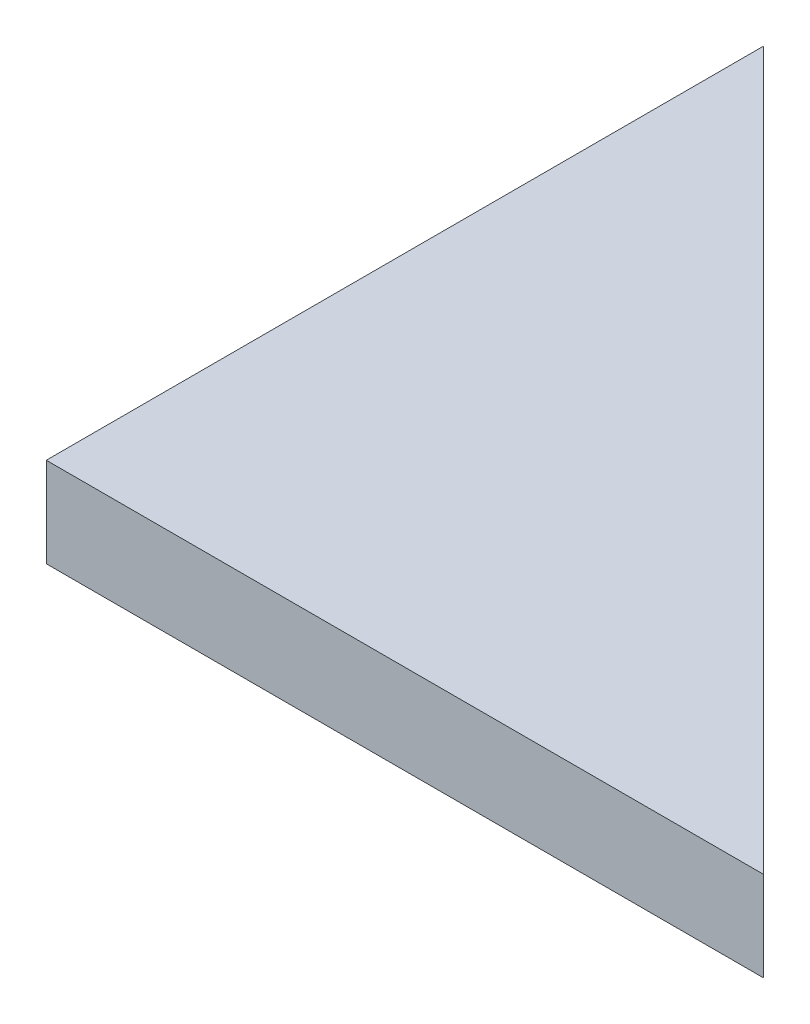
ISO-10303-21;
HEADER;
FILE_DESCRIPTION(('STEP AP214'),'2;1');
FILE_NAME('part.step','',(''),(''),'','','');
FILE_SCHEMA(('AUTOMOTIVE_DESIGN { 1 0 10303 214 1 1 1 1 }'));
ENDSEC;
DATA;
#1=APPLICATION_CONTEXT('core data for automotive mechanical design processes');
#2=APPLICATION_PROTOCOL_DEFINITION('international standard','automotive_design',2000,#1);
#3=PRODUCT_CONTEXT('',#1,'mechanical');
#4=PRODUCT('Part','Part','',(#3));
#5=PRODUCT_RELATED_PRODUCT_CATEGORY('part','',(#4));
#6=PRODUCT_DEFINITION_FORMATION('','',#4);
#7=PRODUCT_DEFINITION_CONTEXT('part definition',#1,'design');
#8=PRODUCT_DEFINITION('design','',#6,#7);
#9=PRODUCT_DEFINITION_SHAPE('','',#8);
#10=(LENGTH_UNIT() NAMED_UNIT(*) SI_UNIT(.MILLI.,.METRE.));
#11=(NAMED_UNIT(*) PLANE_ANGLE_UNIT() SI_UNIT($,.RADIAN.));
#12=(NAMED_UNIT(*) SI_UNIT($,.STERADIAN.) SOLID_ANGLE_UNIT());
#13=UNCERTAINTY_MEASURE_WITH_UNIT(LENGTH_MEASURE(1.E-05),#10,'distance_accuracy_value','');
#14=(GEOMETRIC_REPRESENTATION_CONTEXT(3) GLOBAL_UNCERTAINTY_ASSIGNED_CONTEXT((#13)) GLOBAL_UNIT_ASSIGNED_CONTEXT((#10,
#11,#12)) REPRESENTATION_CONTEXT('',''));
#15=CARTESIAN_POINT('',(0.,0.,0.));
#16=DIRECTION('',(0.,0.,1.));
#17=DIRECTION('',(1.,0.,0.));
#18=AXIS2_PLACEMENT_3D('',#15,#16,#17);
#19=CARTESIAN_POINT('',(-16.9333333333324,6.35,16.9333333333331));
#20=DIRECTION('',(0.,-1.,0.));
#21=DIRECTION('',(0.,0.,-1.));
#22=AXIS2_PLACEMENT_3D('',#19,#20,#21);
#23=PLANE('',#22);
#24=DIRECTION('',(1.,0.,0.));
#25=VECTOR('',#24,1.);
#26=CARTESIAN_POINT('',(-50.8,6.35,50.8));
#27=LINE('',#26,#25);
#28=CARTESIAN_POINT('',(50.8,6.35,50.8));
#29=VERTEX_POINT('',#28);
#30=CARTESIAN_POINT('',(-50.8,6.35,50.8));
#31=VERTEX_POINT('',#30);
#32=EDGE_CURVE('E19',#29,#31,#27,.F.);
#33=ORIENTED_EDGE('',*,*,#32,.F.);
#34=DIRECTION('',(-0.707106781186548,0.,-0.707106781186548));
#35=VECTOR('',#34,1.);
#36=CARTESIAN_POINT('',(50.8,6.35,50.8));
#37=LINE('',#36,#35);
#38=CARTESIAN_POINT('',(-50.8,6.35,-50.8));
#39=VERTEX_POINT('',#38);
#40=EDGE_CURVE('E58',#39,#29,#37,.F.);
#41=ORIENTED_EDGE('',*,*,#40,.F.);
#42=DIRECTION('',(0.,0.,1.));
#43=VECTOR('',#42,1.);
#44=CARTESIAN_POINT('',(-50.8,6.35,-50.8));
#45=LINE('',#44,#43);
#46=EDGE_CURVE('E47',#31,#39,#45,.F.);
#47=ORIENTED_EDGE('',*,*,#46,.F.);
#48=EDGE_LOOP('',(#33,#41,#47));
#49=FACE_BOUND('',#48,.T.);
#50=ADVANCED_FACE('F16',(#49),#23,.F.);
#51=CARTESIAN_POINT('',(-50.8,6.35,50.8));
#52=DIRECTION('',(0.,0.,1.));
#53=DIRECTION('',(1.,0.,0.));
#54=AXIS2_PLACEMENT_3D('',#51,#52,#53);
#55=PLANE('',#54);
#56=ORIENTED_EDGE('',*,*,#32,.T.);
#57=DIRECTION('',(0.,1.,0.));
#58=VECTOR('',#57,1.);
#59=CARTESIAN_POINT('',(-50.8,6.35,50.8));
#60=LINE('',#59,#58);
#61=CARTESIAN_POINT('',(-50.8,-6.35,50.8));
#62=VERTEX_POINT('',#61);
#63=EDGE_CURVE('E53',#62,#31,#60,.T.);
#64=ORIENTED_EDGE('',*,*,#63,.F.);
#65=DIRECTION('',(1.,0.,0.));
#66=VECTOR('',#65,1.);
#67=CARTESIAN_POINT('',(-50.8,-6.35,50.8));
#68=LINE('',#67,#66);
#69=CARTESIAN_POINT('',(50.8,-6.35,50.8));
#70=VERTEX_POINT('',#69);
#71=EDGE_CURVE('E67',#70,#62,#68,.F.);
#72=ORIENTED_EDGE('',*,*,#71,.F.);
#73=DIRECTION('',(0.,1.,0.));
#74=VECTOR('',#73,1.);
#75=CARTESIAN_POINT('',(50.8,6.35,50.8));
#76=LINE('',#75,#74);
#77=EDGE_CURVE('E55',#29,#70,#76,.F.);
#78=ORIENTED_EDGE('',*,*,#77,.F.);
#79=EDGE_LOOP('',(#56,#64,#72,#78));
#80=FACE_BOUND('',#79,.T.);
#81=ADVANCED_FACE('F52',(#80),#55,.T.);
#82=CARTESIAN_POINT('',(-50.8,6.35,-50.8));
#83=DIRECTION('',(-1.,0.,0.));
#84=DIRECTION('',(0.,0.,1.));
#85=AXIS2_PLACEMENT_3D('',#82,#83,#84);
#86=PLANE('',#85);
#87=ORIENTED_EDGE('',*,*,#46,.T.);
#88=DIRECTION('',(0.,1.,0.));
#89=VECTOR('',#88,1.);
#90=CARTESIAN_POINT('',(-50.8,6.35,-50.8));
#91=LINE('',#90,#89);
#92=CARTESIAN_POINT('',(-50.8,-6.35,-50.8));
#93=VERTEX_POINT('',#92);
#94=EDGE_CURVE('E34',#93,#39,#91,.T.);
#95=ORIENTED_EDGE('',*,*,#94,.F.);
#96=DIRECTION('',(0.,0.,-1.));
#97=VECTOR('',#96,1.);
#98=CARTESIAN_POINT('',(-50.8,-6.35,50.8));
#99=LINE('',#98,#97);
#100=EDGE_CURVE('E25',#62,#93,#99,.T.);
#101=ORIENTED_EDGE('',*,*,#100,.F.);
#102=ORIENTED_EDGE('',*,*,#63,.T.);
#103=EDGE_LOOP('',(#87,#95,#101,#102));
#104=FACE_BOUND('',#103,.T.);
#105=ADVANCED_FACE('F60',(#104),#86,.T.);
#106=CARTESIAN_POINT('',(50.8,6.35,50.8));
#107=DIRECTION('',(0.707106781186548,0.,-0.707106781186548));
#108=DIRECTION('',(-0.707106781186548,0.,-0.707106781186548));
#109=AXIS2_PLACEMENT_3D('',#106,#107,#108);
#110=PLANE('',#109);
#111=ORIENTED_EDGE('',*,*,#40,.T.);
#112=ORIENTED_EDGE('',*,*,#77,.T.);
#113=DIRECTION('',(0.707106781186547,0.,0.707106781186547));
#114=VECTOR('',#113,1.);
#115=CARTESIAN_POINT('',(-50.8,-6.35,-50.8));
#116=LINE('',#115,#114);
#117=EDGE_CURVE('E11',#93,#70,#116,.T.);
#118=ORIENTED_EDGE('',*,*,#117,.F.);
#119=ORIENTED_EDGE('',*,*,#94,.T.);
#120=EDGE_LOOP('',(#111,#112,#118,#119));
#121=FACE_BOUND('',#120,.T.);
#122=ADVANCED_FACE('F72',(#121),#110,.T.);
#123=CARTESIAN_POINT('',(-50.8,-6.35,50.8));
#124=DIRECTION('',(0.,-1.,0.));
#125=DIRECTION('',(0.,0.,-1.));
#126=AXIS2_PLACEMENT_3D('',#123,#124,#125);
#127=PLANE('',#126);
#128=ORIENTED_EDGE('',*,*,#100,.T.);
#129=ORIENTED_EDGE('',*,*,#117,.T.);
#130=ORIENTED_EDGE('',*,*,#71,.T.);
#131=EDGE_LOOP('',(#128,#129,#130));
#132=FACE_BOUND('',#131,.T.);
#133=ADVANCED_FACE('F70',(#132),#127,.T.);
#134=CLOSED_SHELL('',(#50,#81,#105,#122,#133));
#135=MANIFOLD_SOLID_BREP('B1',#134);
#136=ADVANCED_BREP_SHAPE_REPRESENTATION('',(#18,#135),#14);
#137=SHAPE_DEFINITION_REPRESENTATION(#9,#136);
ENDSEC;
END-ISO-10303-21;
